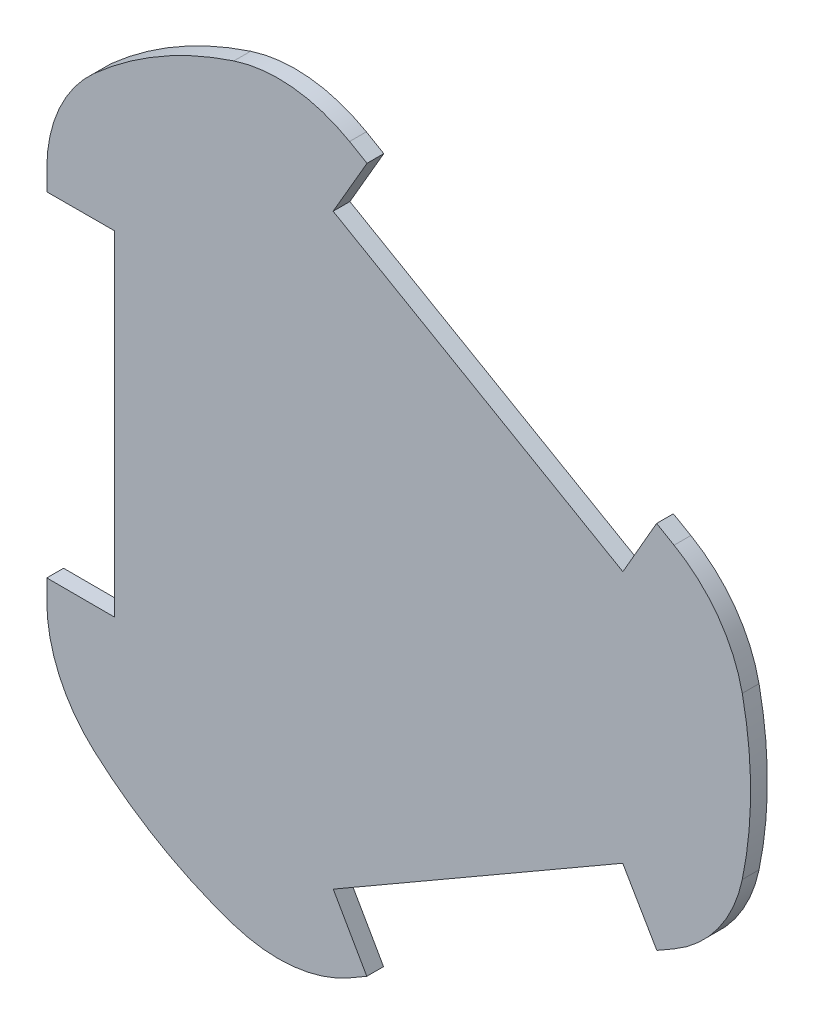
from build123d import *

# Parameters (mm, degrees)
SKETCH1_R           = 5
BOSS_EXTRUDE1_DEPTH = 2
SKETCH2_R           = 6
BOSS_EXTRUDE2_DEPTH = 2
SKETCH4_R           = 4
BOSS_EXTRUDE3_DEPTH = 1


with BuildPart() as part:
    # Sketch1 → Boss-Extrude1 (new body)
    with BuildSketch(Plane.XY):
        with BuildLine():
            Line((26.754759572, 15.066584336), (-7.828159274, 35.03304384))
            Line((-7.828159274, 35.03304384), (-3.776725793, 42.017662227))
            Line((-3.776725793, 42.017662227), (-5.864916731, 43.223279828))
            ThreePointArc((-5.864916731, 43.223279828), (-10.564626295, 45.070633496), (-15.599655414, 45.455948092))
            ThreePointArc((-15.599655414, 45.455948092), (-17.660328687, 45.178385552), (-19.671702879, 44.651328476))
            ThreePointArc((-19.671702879, 44.651328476), (-28.5, 40.703193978), (-36.333333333, 35.031731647))
            ThreePointArc((-36.333333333, 35.031731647), (-37.795465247, 33.553359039), (-39.066178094, 31.907544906))
            ThreePointArc((-39.066178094, 31.907544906), (-41.250000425, 27.354424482), (-42, 22.360679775))
            Line((-42, 22.360679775), (-42, 19.950798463))
            Line((-42, 19.950798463), (-33.9254247, 19.967136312))
            Line((-33.9254247, 19.967136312), (-33.9254247, -19.965779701))
            Line((-33.9254247, -19.965779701), (-42, -19.949444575))
            Line((-42, -19.949444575), (-42, -22.360679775))
            ThreePointArc((-42, -22.360679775), (-41.250000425, -27.354424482), (-39.066178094, -31.907544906))
            ThreePointArc((-39.066178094, -31.907544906), (-37.795465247, -33.553359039), (-36.333333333, -35.031731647))
            ThreePointArc((-36.333333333, -35.031731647), (-28.5, -40.703193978), (-19.671702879, -44.651328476))
            ThreePointArc((-19.671702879, -44.651328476), (-17.660328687, -45.178385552), (-15.599655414, -45.455948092))
            ThreePointArc((-15.599655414, -45.455948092), (-10.564626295, -45.070633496), (-5.864916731, -43.223279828))
            Line((-5.864916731, -43.223279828), (-3.808380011, -42.035937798))
            Line((-3.808380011, -42.035937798), (-7.811356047, -35.023340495))
            Line((-7.811356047, -35.023340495), (26.735608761, -15.07764306))
            Line((26.735608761, -15.07764306), (30.807203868, -22.050621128))
            Line((30.807203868, -22.050621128), (32.864916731, -20.862600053))
            ThreePointArc((32.864916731, -20.862600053), (36.81462672, -17.716209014), (39.665833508, -13.548403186))
            ThreePointArc((39.665833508, -13.548403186), (40.455793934, -11.625026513), (41.005036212, -9.619596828))
            ThreePointArc((41.005036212, -9.619596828), (42, 0), (41.005036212, 9.619596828))
            ThreePointArc((41.005036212, 9.619596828), (40.455793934, 11.625026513), (39.665833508, 13.548403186))
            ThreePointArc((39.665833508, 13.548403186), (36.81462672, 17.716209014), (32.864916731, 20.862600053))
            Line((32.864916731, 20.862600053), (30.777898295, 22.067540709))
            Line((30.777898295, 22.067540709), (26.754759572, 15.066584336))
        make_face()
        with Locations((-25, 34.641016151)):
            Circle(SKETCH1_R, mode=Mode.SUBTRACT)
        with Locations((35, 0)):
            Circle(SKETCH1_R, mode=Mode.SUBTRACT)
        with Locations((-25, -34.641016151)):
            Circle(SKETCH1_R, mode=Mode.SUBTRACT)
    extrude(amount=BOSS_EXTRUDE1_DEPTH)

    # Sketch2 → Boss-Extrude2 (add)
    with BuildSketch(Plane.XY.offset(2)):
        with Locations((-25, 34.641016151)):
            Circle(SKETCH2_R)
        with Locations((-25, -34.641016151)):
            Circle(SKETCH2_R)
        with Locations((35, 0)):
            Circle(SKETCH2_R)
    extrude(amount=-BOSS_EXTRUDE2_DEPTH)

    # Sketch4 → Boss-Extrude3 (add)
    with BuildSketch(Plane(origin=(0, 0, 0), x_dir=(-1, 0, 0), z_dir=(0, 0, -1))):
        with Locations(Location((25, 34.641016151, 0), (0, 0, 180))):
            Circle(SKETCH4_R)
        with Locations(Location((-35, 0, 0), (0, 0, 180))):
            Circle(SKETCH4_R)
        with Locations(Location((25, -34.641016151, 0), (0, 0, 180))):
            Circle(SKETCH4_R)
    extrude(amount=BOSS_EXTRUDE3_DEPTH)


solid = part.part
